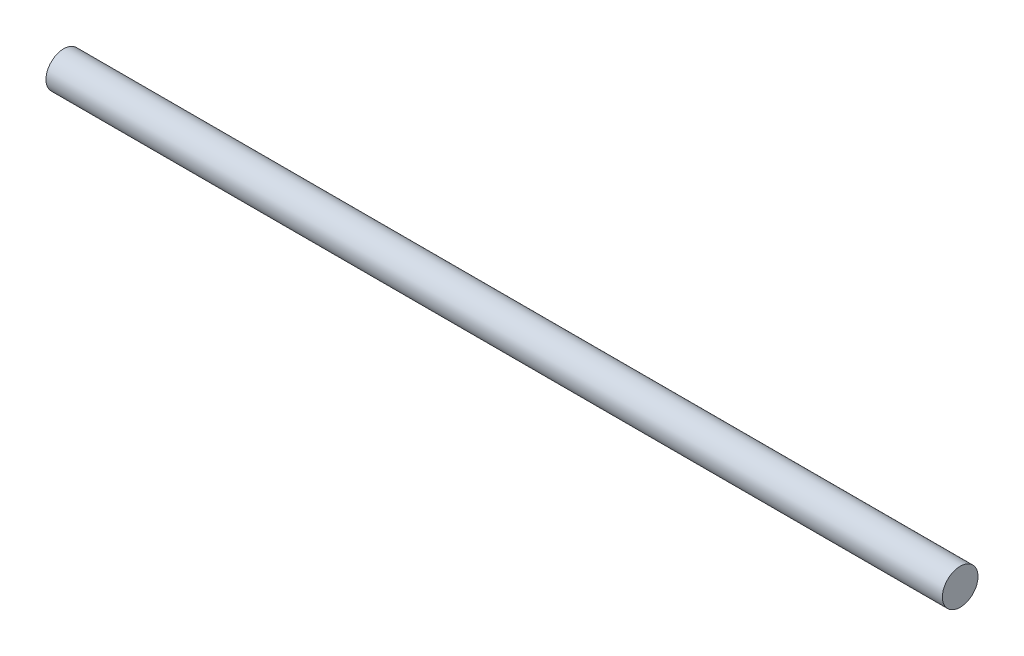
from build123d import *

# Parameters (mm, degrees)
SKETCH1_R           = 3
BOSS_EXTRUDE1_DEPTH = 151


with BuildPart() as part:
    # Sketch1 → Boss-Extrude1 (new body)
    with BuildSketch(Plane(origin=(0, 0, 0), x_dir=(0, 0, -1), z_dir=(1, 0, 0))):
        Circle(SKETCH1_R)
    extrude(amount=BOSS_EXTRUDE1_DEPTH)


solid = part.part
